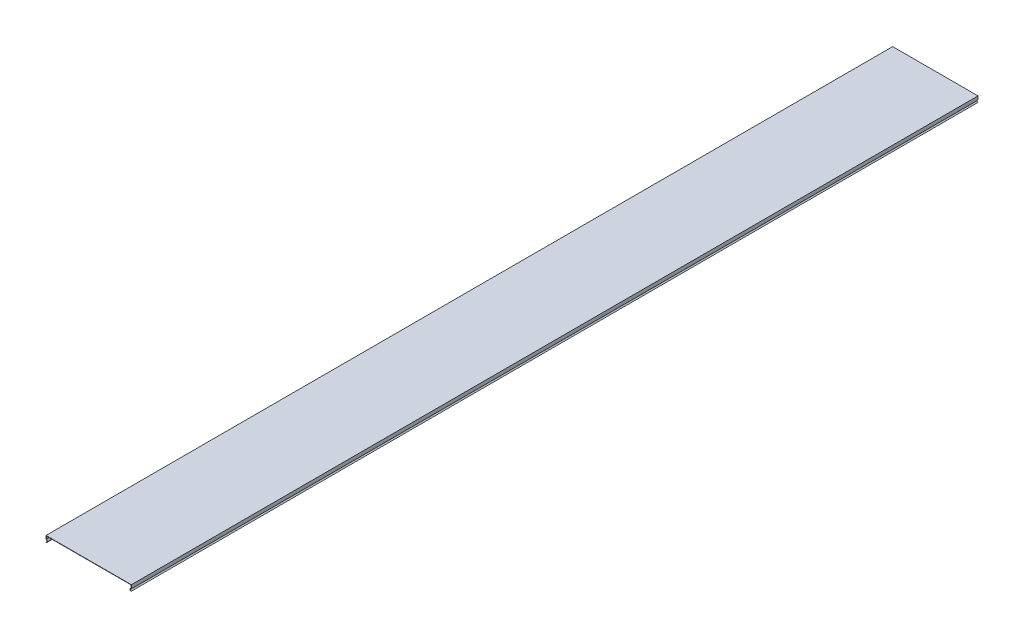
ISO-10303-21;
HEADER;
FILE_DESCRIPTION(('STEP AP214'),'2;1');
FILE_NAME('part.step','',(''),(''),'','','');
FILE_SCHEMA(('AUTOMOTIVE_DESIGN { 1 0 10303 214 1 1 1 1 }'));
ENDSEC;
DATA;
#1=APPLICATION_CONTEXT('core data for automotive mechanical design processes');
#2=APPLICATION_PROTOCOL_DEFINITION('international standard','automotive_design',2000,#1);
#3=PRODUCT_CONTEXT('',#1,'mechanical');
#4=PRODUCT('Part','Part','',(#3));
#5=PRODUCT_RELATED_PRODUCT_CATEGORY('part','',(#4));
#6=PRODUCT_DEFINITION_FORMATION('','',#4);
#7=PRODUCT_DEFINITION_CONTEXT('part definition',#1,'design');
#8=PRODUCT_DEFINITION('design','',#6,#7);
#9=PRODUCT_DEFINITION_SHAPE('','',#8);
#10=(LENGTH_UNIT() NAMED_UNIT(*) SI_UNIT(.MILLI.,.METRE.));
#11=(NAMED_UNIT(*) PLANE_ANGLE_UNIT() SI_UNIT($,.RADIAN.));
#12=(NAMED_UNIT(*) SI_UNIT($,.STERADIAN.) SOLID_ANGLE_UNIT());
#13=UNCERTAINTY_MEASURE_WITH_UNIT(LENGTH_MEASURE(1.E-05),#10,'distance_accuracy_value','');
#14=(GEOMETRIC_REPRESENTATION_CONTEXT(3) GLOBAL_UNCERTAINTY_ASSIGNED_CONTEXT((#13)) GLOBAL_UNIT_ASSIGNED_CONTEXT((#10,
#11,#12)) REPRESENTATION_CONTEXT('',''));
#15=CARTESIAN_POINT('',(0.,0.,0.));
#16=DIRECTION('',(0.,0.,1.));
#17=DIRECTION('',(1.,0.,0.));
#18=AXIS2_PLACEMENT_3D('',#15,#16,#17);
#19=CARTESIAN_POINT('',(0.,0.,3000.));
#20=DIRECTION('',(1.,0.,0.));
#21=DIRECTION('',(0.,1.,0.));
#22=AXIS2_PLACEMENT_3D('',#19,#20,#21);
#23=PLANE('',#22);
#24=DIRECTION('',(0.,-1.,0.));
#25=VECTOR('',#24,1.);
#26=CARTESIAN_POINT('',(0.,0.,0.));
#27=LINE('',#26,#25);
#28=CARTESIAN_POINT('',(0.,0.,0.));
#29=VERTEX_POINT('',#28);
#30=CARTESIAN_POINT('',(0.,-12.428,0.));
#31=VERTEX_POINT('',#30);
#32=EDGE_CURVE('E150',#29,#31,#27,.T.);
#33=ORIENTED_EDGE('',*,*,#32,.T.);
#34=DIRECTION('',(0.,0.,-1.));
#35=VECTOR('',#34,1.);
#36=CARTESIAN_POINT('',(0.,-12.428,3000.));
#37=LINE('',#36,#35);
#38=CARTESIAN_POINT('',(0.,-12.428,3000.));
#39=VERTEX_POINT('',#38);
#40=EDGE_CURVE('E11',#39,#31,#37,.T.);
#41=ORIENTED_EDGE('',*,*,#40,.F.);
#42=DIRECTION('',(0.,-1.,0.));
#43=VECTOR('',#42,1.);
#44=CARTESIAN_POINT('',(0.,0.,3000.));
#45=LINE('',#44,#43);
#46=CARTESIAN_POINT('',(0.,0.,3000.));
#47=VERTEX_POINT('',#46);
#48=EDGE_CURVE('E172',#47,#39,#45,.T.);
#49=ORIENTED_EDGE('',*,*,#48,.F.);
#50=DIRECTION('',(0.,0.,-1.));
#51=VECTOR('',#50,1.);
#52=CARTESIAN_POINT('',(0.,0.,3000.));
#53=LINE('',#52,#51);
#54=EDGE_CURVE('E146',#47,#29,#53,.T.);
#55=ORIENTED_EDGE('',*,*,#54,.T.);
#56=EDGE_LOOP('',(#33,#41,#49,#55));
#57=FACE_BOUND('',#56,.T.);
#58=ADVANCED_FACE('F30',(#57),#23,.F.);
#59=CARTESIAN_POINT('',(0.,-16.214,3000.));
#60=DIRECTION('',(0.,0.,-1.));
#61=DIRECTION('',(-1.,0.,0.));
#62=AXIS2_PLACEMENT_3D('',#59,#60,#61);
#63=CYLINDRICAL_SURFACE('',#62,3.786);
#64=CARTESIAN_POINT('',(0.,-16.214,0.));
#65=DIRECTION('',(0.,0.,-1.));
#66=DIRECTION('',(-1.,0.,0.));
#67=AXIS2_PLACEMENT_3D('',#64,#65,#66);
#68=CIRCLE('',#67,3.786);
#69=CARTESIAN_POINT('',(0.,-20.,0.));
#70=VERTEX_POINT('',#69);
#71=EDGE_CURVE('E153',#31,#70,#68,.T.);
#72=ORIENTED_EDGE('',*,*,#71,.T.);
#73=DIRECTION('',(0.,0.,-1.));
#74=VECTOR('',#73,1.);
#75=CARTESIAN_POINT('',(0.,-20.,3000.));
#76=LINE('',#75,#74);
#77=CARTESIAN_POINT('',(0.,-20.,3000.));
#78=VERTEX_POINT('',#77);
#79=EDGE_CURVE('E38',#78,#70,#76,.T.);
#80=ORIENTED_EDGE('',*,*,#79,.F.);
#81=CARTESIAN_POINT('',(0.,-16.214,3000.));
#82=DIRECTION('',(0.,0.,-1.));
#83=DIRECTION('',(-1.,0.,0.));
#84=AXIS2_PLACEMENT_3D('',#81,#82,#83);
#85=CIRCLE('',#84,3.786);
#86=EDGE_CURVE('E101',#39,#78,#85,.T.);
#87=ORIENTED_EDGE('',*,*,#86,.F.);
#88=ORIENTED_EDGE('',*,*,#40,.T.);
#89=EDGE_LOOP('',(#72,#80,#87,#88));
#90=FACE_BOUND('',#89,.T.);
#91=ADVANCED_FACE('F250',(#90),#63,.F.);
#92=CARTESIAN_POINT('',(0.,-20.,3000.));
#93=DIRECTION('',(0.707106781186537,0.707106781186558,0.));
#94=DIRECTION('',(-0.707106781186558,0.707106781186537,0.));
#95=AXIS2_PLACEMENT_3D('',#92,#93,#94);
#96=PLANE('',#95);
#97=DIRECTION('',(0.707106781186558,-0.707106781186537,0.));
#98=VECTOR('',#97,1.);
#99=CARTESIAN_POINT('',(0.,-20.,0.));
#100=LINE('',#99,#98);
#101=CARTESIAN_POINT('',(1.09305944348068,-21.0930594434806,0.));
#102=VERTEX_POINT('',#101);
#103=EDGE_CURVE('E155',#70,#102,#100,.T.);
#104=ORIENTED_EDGE('',*,*,#103,.T.);
#105=DIRECTION('',(0.,0.,-1.));
#106=VECTOR('',#105,1.);
#107=CARTESIAN_POINT('',(1.09305944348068,-21.0930594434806,3000.));
#108=LINE('',#107,#106);
#109=CARTESIAN_POINT('',(1.09305944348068,-21.0930594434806,3000.));
#110=VERTEX_POINT('',#109);
#111=EDGE_CURVE('E191',#110,#102,#108,.T.);
#112=ORIENTED_EDGE('',*,*,#111,.F.);
#113=DIRECTION('',(0.707106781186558,-0.707106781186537,0.));
#114=VECTOR('',#113,1.);
#115=CARTESIAN_POINT('',(0.,-20.,3000.));
#116=LINE('',#115,#114);
#117=EDGE_CURVE('E199',#78,#110,#116,.T.);
#118=ORIENTED_EDGE('',*,*,#117,.F.);
#119=ORIENTED_EDGE('',*,*,#79,.T.);
#120=EDGE_LOOP('',(#104,#112,#118,#119));
#121=FACE_BOUND('',#120,.T.);
#122=ADVANCED_FACE('F197',(#121),#96,.F.);
#123=CARTESIAN_POINT('',(0.,-16.214,3000.));
#124=DIRECTION('',(0.,0.,-1.));
#125=DIRECTION('',(-1.,0.,0.));
#126=AXIS2_PLACEMENT_3D('',#123,#124,#125);
#127=CYLINDRICAL_SURFACE('',#126,5.);
#128=CARTESIAN_POINT('',(0.,-16.214,0.));
#129=DIRECTION('',(0.,0.,1.));
#130=DIRECTION('',(-1.,0.,0.));
#131=AXIS2_PLACEMENT_3D('',#128,#129,#130);
#132=CIRCLE('',#131,5.);
#133=CARTESIAN_POINT('',(1.214,-11.3636181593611,0.));
#134=VERTEX_POINT('',#133);
#135=EDGE_CURVE('E157',#102,#134,#132,.T.);
#136=ORIENTED_EDGE('',*,*,#135,.T.);
#137=DIRECTION('',(0.,0.,-1.));
#138=VECTOR('',#137,1.);
#139=CARTESIAN_POINT('',(1.214,-11.3636181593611,3000.));
#140=LINE('',#139,#138);
#141=CARTESIAN_POINT('',(1.214,-11.3636181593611,3000.));
#142=VERTEX_POINT('',#141);
#143=EDGE_CURVE('E188',#142,#134,#140,.T.);
#144=ORIENTED_EDGE('',*,*,#143,.F.);
#145=CARTESIAN_POINT('',(0.,-16.214,3000.));
#146=DIRECTION('',(0.,0.,1.));
#147=DIRECTION('',(-1.,0.,0.));
#148=AXIS2_PLACEMENT_3D('',#145,#146,#147);
#149=CIRCLE('',#148,5.);
#150=EDGE_CURVE('E217',#110,#142,#149,.T.);
#151=ORIENTED_EDGE('',*,*,#150,.F.);
#152=ORIENTED_EDGE('',*,*,#111,.T.);
#153=EDGE_LOOP('',(#136,#144,#151,#152));
#154=FACE_BOUND('',#153,.T.);
#155=ADVANCED_FACE('F208',(#154),#127,.T.);
#156=CARTESIAN_POINT('',(1.214,-1.214,3000.));
#157=DIRECTION('',(-1.,0.,0.));
#158=DIRECTION('',(0.,-1.,0.));
#159=AXIS2_PLACEMENT_3D('',#156,#157,#158);
#160=PLANE('',#159);
#161=DIRECTION('',(0.,1.,0.));
#162=VECTOR('',#161,1.);
#163=CARTESIAN_POINT('',(1.214,-1.214,0.));
#164=LINE('',#163,#162);
#165=CARTESIAN_POINT('',(1.214,-1.214,0.));
#166=VERTEX_POINT('',#165);
#167=EDGE_CURVE('E159',#134,#166,#164,.T.);
#168=ORIENTED_EDGE('',*,*,#167,.T.);
#169=DIRECTION('',(0.,0.,-1.));
#170=VECTOR('',#169,1.);
#171=CARTESIAN_POINT('',(1.214,-1.214,3000.));
#172=LINE('',#171,#170);
#173=CARTESIAN_POINT('',(1.214,-1.214,3000.));
#174=VERTEX_POINT('',#173);
#175=EDGE_CURVE('E185',#174,#166,#172,.T.);
#176=ORIENTED_EDGE('',*,*,#175,.F.);
#177=DIRECTION('',(0.,1.,0.));
#178=VECTOR('',#177,1.);
#179=CARTESIAN_POINT('',(1.214,-1.214,3000.));
#180=LINE('',#179,#178);
#181=EDGE_CURVE('E214',#142,#174,#180,.T.);
#182=ORIENTED_EDGE('',*,*,#181,.F.);
#183=ORIENTED_EDGE('',*,*,#143,.T.);
#184=EDGE_LOOP('',(#168,#176,#182,#183));
#185=FACE_BOUND('',#184,.T.);
#186=ADVANCED_FACE('F212',(#185),#160,.F.);
#187=CARTESIAN_POINT('',(1.214,-1.214,3000.));
#188=DIRECTION('',(0.,1.,0.));
#189=DIRECTION('',(0.,0.,1.));
#190=AXIS2_PLACEMENT_3D('',#187,#188,#189);
#191=PLANE('',#190);
#192=DIRECTION('',(1.,0.,0.));
#193=VECTOR('',#192,1.);
#194=CARTESIAN_POINT('',(1.214,-1.214,0.));
#195=LINE('',#194,#193);
#196=CARTESIAN_POINT('',(301.214,-1.214,0.));
#197=VERTEX_POINT('',#196);
#198=EDGE_CURVE('E161',#166,#197,#195,.T.);
#199=ORIENTED_EDGE('',*,*,#198,.T.);
#200=DIRECTION('',(0.,0.,-1.));
#201=VECTOR('',#200,1.);
#202=CARTESIAN_POINT('',(301.214,-1.214,3000.));
#203=LINE('',#202,#201);
#204=CARTESIAN_POINT('',(301.214,-1.214,3000.));
#205=VERTEX_POINT('',#204);
#206=EDGE_CURVE('E182',#205,#197,#203,.T.);
#207=ORIENTED_EDGE('',*,*,#206,.F.);
#208=DIRECTION('',(1.,0.,0.));
#209=VECTOR('',#208,1.);
#210=CARTESIAN_POINT('',(1.214,-1.214,3000.));
#211=LINE('',#210,#209);
#212=EDGE_CURVE('E216',#174,#205,#211,.T.);
#213=ORIENTED_EDGE('',*,*,#212,.F.);
#214=ORIENTED_EDGE('',*,*,#175,.T.);
#215=EDGE_LOOP('',(#199,#207,#213,#214));
#216=FACE_BOUND('',#215,.T.);
#217=ADVANCED_FACE('F263',(#216),#191,.F.);
#218=CARTESIAN_POINT('',(301.214,-1.214,3000.));
#219=DIRECTION('',(1.,0.,0.));
#220=DIRECTION('',(0.,0.,-1.));
#221=AXIS2_PLACEMENT_3D('',#218,#219,#220);
#222=PLANE('',#221);
#223=DIRECTION('',(0.,-1.,0.));
#224=VECTOR('',#223,1.);
#225=CARTESIAN_POINT('',(301.214,-1.214,0.));
#226=LINE('',#225,#224);
#227=CARTESIAN_POINT('',(301.214,-11.3636181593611,0.));
#228=VERTEX_POINT('',#227);
#229=EDGE_CURVE('E163',#197,#228,#226,.T.);
#230=ORIENTED_EDGE('',*,*,#229,.T.);
#231=DIRECTION('',(0.,0.,-1.));
#232=VECTOR('',#231,1.);
#233=CARTESIAN_POINT('',(301.214,-11.3636181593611,3000.));
#234=LINE('',#233,#232);
#235=CARTESIAN_POINT('',(301.214,-11.3636181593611,3000.));
#236=VERTEX_POINT('',#235);
#237=EDGE_CURVE('E179',#236,#228,#234,.T.);
#238=ORIENTED_EDGE('',*,*,#237,.F.);
#239=DIRECTION('',(0.,-1.,0.));
#240=VECTOR('',#239,1.);
#241=CARTESIAN_POINT('',(301.214,-1.214,3000.));
#242=LINE('',#241,#240);
#243=EDGE_CURVE('E219',#205,#236,#242,.T.);
#244=ORIENTED_EDGE('',*,*,#243,.F.);
#245=ORIENTED_EDGE('',*,*,#206,.T.);
#246=EDGE_LOOP('',(#230,#238,#244,#245));
#247=FACE_BOUND('',#246,.T.);
#248=ADVANCED_FACE('F266',(#247),#222,.F.);
#249=CARTESIAN_POINT('',(302.428,-16.214,3000.));
#250=DIRECTION('',(0.,0.,-1.));
#251=DIRECTION('',(-1.,0.,0.));
#252=AXIS2_PLACEMENT_3D('',#249,#250,#251);
#253=CYLINDRICAL_SURFACE('',#252,5.00000000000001);
#254=CARTESIAN_POINT('',(302.428,-16.214,0.));
#255=DIRECTION('',(0.,0.,1.));
#256=DIRECTION('',(1.,0.,0.));
#257=AXIS2_PLACEMENT_3D('',#254,#255,#256);
#258=CIRCLE('',#257,5.00000000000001);
#259=CARTESIAN_POINT('',(301.334940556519,-21.0930594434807,0.));
#260=VERTEX_POINT('',#259);
#261=EDGE_CURVE('E165',#228,#260,#258,.T.);
#262=ORIENTED_EDGE('',*,*,#261,.T.);
#263=DIRECTION('',(0.,0.,-1.));
#264=VECTOR('',#263,1.);
#265=CARTESIAN_POINT('',(301.334940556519,-21.0930594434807,3000.));
#266=LINE('',#265,#264);
#267=CARTESIAN_POINT('',(301.334940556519,-21.0930594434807,3000.));
#268=VERTEX_POINT('',#267);
#269=EDGE_CURVE('E176',#268,#260,#266,.T.);
#270=ORIENTED_EDGE('',*,*,#269,.F.);
#271=CARTESIAN_POINT('',(302.428,-16.214,3000.));
#272=DIRECTION('',(0.,0.,1.));
#273=DIRECTION('',(1.,0.,0.));
#274=AXIS2_PLACEMENT_3D('',#271,#272,#273);
#275=CIRCLE('',#274,5.00000000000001);
#276=EDGE_CURVE('E225',#236,#268,#275,.T.);
#277=ORIENTED_EDGE('',*,*,#276,.F.);
#278=ORIENTED_EDGE('',*,*,#237,.T.);
#279=EDGE_LOOP('',(#262,#270,#277,#278));
#280=FACE_BOUND('',#279,.T.);
#281=ADVANCED_FACE('F231',(#280),#253,.T.);
#282=CARTESIAN_POINT('',(302.428,-20.,3000.));
#283=DIRECTION('',(-0.707106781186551,0.707106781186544,0.));
#284=DIRECTION('',(-0.707106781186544,-0.707106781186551,0.));
#285=AXIS2_PLACEMENT_3D('',#282,#283,#284);
#286=PLANE('',#285);
#287=DIRECTION('',(0.707106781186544,0.707106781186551,0.));
#288=VECTOR('',#287,1.);
#289=CARTESIAN_POINT('',(302.428,-20.,0.));
#290=LINE('',#289,#288);
#291=CARTESIAN_POINT('',(302.428,-20.,0.));
#292=VERTEX_POINT('',#291);
#293=EDGE_CURVE('E167',#260,#292,#290,.T.);
#294=ORIENTED_EDGE('',*,*,#293,.T.);
#295=DIRECTION('',(0.,0.,-1.));
#296=VECTOR('',#295,1.);
#297=CARTESIAN_POINT('',(302.428,-20.,3000.));
#298=LINE('',#297,#296);
#299=CARTESIAN_POINT('',(302.428,-20.,3000.));
#300=VERTEX_POINT('',#299);
#301=EDGE_CURVE('E141',#300,#292,#298,.T.);
#302=ORIENTED_EDGE('',*,*,#301,.F.);
#303=DIRECTION('',(0.707106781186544,0.707106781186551,0.));
#304=VECTOR('',#303,1.);
#305=CARTESIAN_POINT('',(302.428,-20.,3000.));
#306=LINE('',#305,#304);
#307=EDGE_CURVE('E132',#268,#300,#306,.T.);
#308=ORIENTED_EDGE('',*,*,#307,.F.);
#309=ORIENTED_EDGE('',*,*,#269,.T.);
#310=EDGE_LOOP('',(#294,#302,#308,#309));
#311=FACE_BOUND('',#310,.T.);
#312=ADVANCED_FACE('F235',(#311),#286,.F.);
#313=CARTESIAN_POINT('',(302.428,-16.214,3000.));
#314=DIRECTION('',(0.,0.,-1.));
#315=DIRECTION('',(-1.,0.,0.));
#316=AXIS2_PLACEMENT_3D('',#313,#314,#315);
#317=CYLINDRICAL_SURFACE('',#316,3.786);
#318=CARTESIAN_POINT('',(302.428,-16.214,0.));
#319=DIRECTION('',(0.,0.,-1.));
#320=DIRECTION('',(1.,0.,0.));
#321=AXIS2_PLACEMENT_3D('',#318,#319,#320);
#322=CIRCLE('',#321,3.786);
#323=CARTESIAN_POINT('',(302.428,-12.428,0.));
#324=VERTEX_POINT('',#323);
#325=EDGE_CURVE('E140',#292,#324,#322,.T.);
#326=ORIENTED_EDGE('',*,*,#325,.T.);
#327=DIRECTION('',(0.,0.,-1.));
#328=VECTOR('',#327,1.);
#329=CARTESIAN_POINT('',(302.428,-12.428,3000.));
#330=LINE('',#329,#328);
#331=CARTESIAN_POINT('',(302.428,-12.428,3000.));
#332=VERTEX_POINT('',#331);
#333=EDGE_CURVE('E137',#332,#324,#330,.T.);
#334=ORIENTED_EDGE('',*,*,#333,.F.);
#335=CARTESIAN_POINT('',(302.428,-16.214,3000.));
#336=DIRECTION('',(0.,0.,-1.));
#337=DIRECTION('',(1.,0.,0.));
#338=AXIS2_PLACEMENT_3D('',#335,#336,#337);
#339=CIRCLE('',#338,3.786);
#340=EDGE_CURVE('E126',#300,#332,#339,.T.);
#341=ORIENTED_EDGE('',*,*,#340,.F.);
#342=ORIENTED_EDGE('',*,*,#301,.T.);
#343=EDGE_LOOP('',(#326,#334,#341,#342));
#344=FACE_BOUND('',#343,.T.);
#345=ADVANCED_FACE('F138',(#344),#317,.F.);
#346=CARTESIAN_POINT('',(302.428,0.,3000.));
#347=DIRECTION('',(-1.,0.,0.));
#348=DIRECTION('',(0.,0.,1.));
#349=AXIS2_PLACEMENT_3D('',#346,#347,#348);
#350=PLANE('',#349);
#351=DIRECTION('',(0.,1.,0.));
#352=VECTOR('',#351,1.);
#353=CARTESIAN_POINT('',(302.428,0.,0.));
#354=LINE('',#353,#352);
#355=CARTESIAN_POINT('',(302.428,0.,0.));
#356=VERTEX_POINT('',#355);
#357=EDGE_CURVE('E87',#324,#356,#354,.T.);
#358=ORIENTED_EDGE('',*,*,#357,.T.);
#359=DIRECTION('',(0.,0.,-1.));
#360=VECTOR('',#359,1.);
#361=CARTESIAN_POINT('',(302.428,0.,3000.));
#362=LINE('',#361,#360);
#363=CARTESIAN_POINT('',(302.428,0.,3000.));
#364=VERTEX_POINT('',#363);
#365=EDGE_CURVE('E142',#364,#356,#362,.T.);
#366=ORIENTED_EDGE('',*,*,#365,.F.);
#367=DIRECTION('',(0.,1.,0.));
#368=VECTOR('',#367,1.);
#369=CARTESIAN_POINT('',(302.428,0.,3000.));
#370=LINE('',#369,#368);
#371=EDGE_CURVE('E130',#332,#364,#370,.T.);
#372=ORIENTED_EDGE('',*,*,#371,.F.);
#373=ORIENTED_EDGE('',*,*,#333,.T.);
#374=EDGE_LOOP('',(#358,#366,#372,#373));
#375=FACE_BOUND('',#374,.T.);
#376=ADVANCED_FACE('F144',(#375),#350,.F.);
#377=CARTESIAN_POINT('',(0.,0.,3000.));
#378=DIRECTION('',(0.,-1.,0.));
#379=DIRECTION('',(0.,0.,-1.));
#380=AXIS2_PLACEMENT_3D('',#377,#378,#379);
#381=PLANE('',#380);
#382=DIRECTION('',(-1.,0.,0.));
#383=VECTOR('',#382,1.);
#384=CARTESIAN_POINT('',(0.,0.,0.));
#385=LINE('',#384,#383);
#386=EDGE_CURVE('E93',#356,#29,#385,.T.);
#387=ORIENTED_EDGE('',*,*,#386,.T.);
#388=ORIENTED_EDGE('',*,*,#54,.F.);
#389=DIRECTION('',(-1.,0.,0.));
#390=VECTOR('',#389,1.);
#391=CARTESIAN_POINT('',(0.,0.,3000.));
#392=LINE('',#391,#390);
#393=EDGE_CURVE('E46',#364,#47,#392,.T.);
#394=ORIENTED_EDGE('',*,*,#393,.F.);
#395=ORIENTED_EDGE('',*,*,#365,.T.);
#396=EDGE_LOOP('',(#387,#388,#394,#395));
#397=FACE_BOUND('',#396,.T.);
#398=ADVANCED_FACE('F239',(#397),#381,.F.);
#399=CARTESIAN_POINT('',(0.,-16.214,3000.));
#400=DIRECTION('',(0.,0.,-1.));
#401=DIRECTION('',(-1.,0.,0.));
#402=AXIS2_PLACEMENT_3D('',#399,#400,#401);
#403=PLANE('',#402);
#404=ORIENTED_EDGE('',*,*,#48,.T.);
#405=ORIENTED_EDGE('',*,*,#86,.T.);
#406=ORIENTED_EDGE('',*,*,#117,.T.);
#407=ORIENTED_EDGE('',*,*,#150,.T.);
#408=ORIENTED_EDGE('',*,*,#181,.T.);
#409=ORIENTED_EDGE('',*,*,#212,.T.);
#410=ORIENTED_EDGE('',*,*,#243,.T.);
#411=ORIENTED_EDGE('',*,*,#276,.T.);
#412=ORIENTED_EDGE('',*,*,#307,.T.);
#413=ORIENTED_EDGE('',*,*,#340,.T.);
#414=ORIENTED_EDGE('',*,*,#371,.T.);
#415=ORIENTED_EDGE('',*,*,#393,.T.);
#416=EDGE_LOOP('',(#404,#405,#406,#407,#408,#409,#410,#411,#412,#413,#414,#415));
#417=FACE_BOUND('',#416,.T.);
#418=ADVANCED_FACE('F128',(#417),#403,.F.);
#419=CARTESIAN_POINT('',(0.,-16.214,0.));
#420=DIRECTION('',(0.,0.,-1.));
#421=DIRECTION('',(-1.,0.,0.));
#422=AXIS2_PLACEMENT_3D('',#419,#420,#421);
#423=PLANE('',#422);
#424=ORIENTED_EDGE('',*,*,#32,.F.);
#425=ORIENTED_EDGE('',*,*,#386,.F.);
#426=ORIENTED_EDGE('',*,*,#357,.F.);
#427=ORIENTED_EDGE('',*,*,#325,.F.);
#428=ORIENTED_EDGE('',*,*,#293,.F.);
#429=ORIENTED_EDGE('',*,*,#261,.F.);
#430=ORIENTED_EDGE('',*,*,#229,.F.);
#431=ORIENTED_EDGE('',*,*,#198,.F.);
#432=ORIENTED_EDGE('',*,*,#167,.F.);
#433=ORIENTED_EDGE('',*,*,#135,.F.);
#434=ORIENTED_EDGE('',*,*,#103,.F.);
#435=ORIENTED_EDGE('',*,*,#71,.F.);
#436=EDGE_LOOP('',(#424,#425,#426,#427,#428,#429,#430,#431,#432,#433,#434,#435));
#437=FACE_BOUND('',#436,.T.);
#438=ADVANCED_FACE('F203',(#437),#423,.T.);
#439=CLOSED_SHELL('',(#58,#91,#122,#155,#186,#217,#248,#281,#312,#345,#376,#398,#418,#438));
#440=MANIFOLD_SOLID_BREP('B2',#439);
#441=ADVANCED_BREP_SHAPE_REPRESENTATION('',(#18,#440),#14);
#442=SHAPE_DEFINITION_REPRESENTATION(#9,#441);
ENDSEC;
END-ISO-10303-21;
